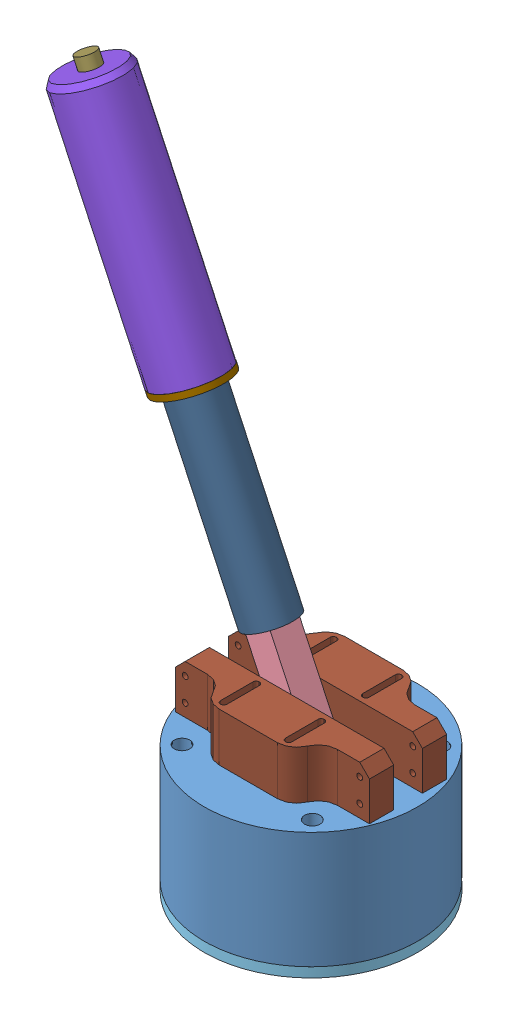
SolidWorks assembly collective.SLDASM, configuration По умолчанию (file format 9000). Lengths in mm.
Overall size (189.21 340.01 110).
14 component instances, 12 part files, 36 mates.
Components (placement in the parent):
- case_collective-1: case_collective.SLDPRT [По умолчанию] at origin size (110 60 110)
- collective_frame_4,5x42mm-1: collective_frame_4,5x42mm.SLDPRT [По умолчанию] at (25.25 42 0) x (0 0 1) z (0 -1 0) size (56 48 30)
- 608_bearing_v1-1: 608_bearing_v1.SLDPRT [По умолчанию] at (9.25 42 10.5) x (1 0 0) z (0 -1 0) size (22 7.15 22)
- 608_bearing_v1-2: 608_bearing_v1.SLDPRT [По умолчанию] at (9.25 42 -10.5) x (1 0 0) z (0 1 0) size (22 7.15 22)
- collective_connector-1: collective_connector.SLDPRT [По умолчанию] at (-4.7734 71.9825 -7.3) x (0 0 1) z (0.423669 -0.905817 0) size (49.8 14.8 74)
- collective_case_bottom_cover-1: collective_case_bottom_cover.SLDPRT [По умолчанию] at (0 -5 0) size (110 30 110)
- aluminium_square_pipe_10x250-1: aluminium_square_pipe_10x250.SLDPRT [По умолчанию] at (7.0893 46.6197 0.1) x (0.905817 0.423669 0) z (0 0 1) size (10 250 10)
- throttle_resistor_mount_v2-1: throttle_resistor_mount_v2.SLDPRT [По умолчанию] at (-111.088 303.7709 0) x (0 0 1) z (0.905817 0.423669 0) size (20 58 22)
- throttle-1: throttle.SLDPRT [По умолчанию] at (-62.0594 194.2255 0) x (-0.28541 -0.133492 -0.949063) z (-0.423669 0.905817 0) size (35 35 123)
- throttle_rear_mount-1: throttle_rear_mount.SLDPRT [По умолчанию] at (-64.1777 198.7546 0) x (-0.905817 -0.423669 0) z (0 0 1) size (35 13 35)
- collective_lever_decorative_cover-1: collective_lever_decorative_cover.SLDPRT [По умолчанию] at (-20.5398 105.4554 0) x (0.905817 0.423669 0) z (0 0 1) size (25 95 25)
- tensioner-3: tensioner.SLDPRT [По умолчанию] at (0.15 60 20) x (0 0 -1) z (1 0 0) size (25 25 100)
- tensioner-4: tensioner.SLDPRT [По умолчанию] at (0.15 60 -19.8) x (0 0 1) z (-1 0 0) size (25 25 100)
- throttle_handle_wedge-1: throttle_handle_wedge.SLDPRT [По умолчанию] at (-116.4891 311.1805 -0.4345) x (-0.447473 -0.209292 0.869462) z (0.787574 0.368364 0.493999) size (10 9 10)
Mates (geometry in assembly coordinates):
- Концентричный2: concentric aligned: cylinder of case_collective-1 through (-16.75 0 -20.5) axis (0 1 0) radius 1.5; cylinder of collective_frame_4,5x42mm-1 through (-16.75 27 -20.5) axis (0 1 0) radius 1.5
- Концентричный4: concentric aligned: cylinder of case_collective-1 through (-16.75 0 20.5) axis (0 1 0) radius 1.5; cylinder of collective_frame_4,5x42mm-1 through (-16.75 27 20.5) axis (0 1 0) radius 1.5
- Совпадение1: coincident anti-aligned: plane of case_collective-1 through (22.5 57 22.5) normal (0 -1 0); plane of collective_frame_4,5x42mm-1 through (-16.75 57 17.5) normal (0 1 0)
- Концентричный5: concentric anti-aligned: cylinder of collective_frame_4,5x42mm-1 through (9.25 42 -10.5) axis (0 0 -1) radius 11.1; cylinder of 608_bearing_v1-2 through (9.25 42 -13.975) axis (0 0 1) radius 11
- Совпадение2: coincident anti-aligned: plane of collective_frame_4,5x42mm-1 through (9.25 42 -10.5) normal (0 0 -1); plane of 608_bearing_v1-2 through (9.25 42 -10.5) normal (0 0 1)
- Концентричный6: concentric anti-aligned: cylinder of collective_frame_4,5x42mm-1 through (9.25 42 10.5) axis (0 0 1) radius 11.1; cylinder of 608_bearing_v1-1 through (9.25 42 13.975) axis (0 0 -1) radius 11
- Совпадение3: coincident anti-aligned: plane of collective_frame_4,5x42mm-1 through (9.25 42 10.5) normal (0 0 1); plane of 608_bearing_v1-1 through (9.25 42 10.5) normal (0 0 -1)
- Концентричный7: concentric aligned: cylinder of 608_bearing_v1-2 through (9.25 42 -13.975) axis (0 0 1) radius 4; cylinder of collective_connector-1 through (9.25 42 -32.3) axis (0 0 1) radius 3.9
- Совпадение4: coincident anti-aligned: plane of 608_bearing_v1-2 through (9.25 42 -10.4) normal (0 0 1); plane of collective_connector-1 through (-4.7734 71.9825 -10.4) normal (0 0 -1)
- Концентричный8: concentric anti-aligned: cylinder of case_collective-1 through (-33.5917 0 -32.8724) axis (0 1 0) radius 4; cylinder of collective_case_bottom_cover-1 through (-33.5917 5 -32.8724) axis (0 -1 0) radius 4.1
- Концентричный9: concentric anti-aligned: cylinder of case_collective-1 through (-33.5917 0 32.8724) axis (0 1 0) radius 4; cylinder of collective_case_bottom_cover-1 through (-33.5917 5 32.8724) axis (0 -1 0) radius 4.1
- Совпадение5: coincident anti-aligned: plane of case_collective-1 through (0 0 0) normal (0 -1 0); plane of collective_case_bottom_cover-1 through (0 0 0) normal (0 1 0)
- Совпадение6: coincident anti-aligned: plane of collective_connector-1 through (2.5602 44.5013 -4.9) normal (0.905817 0.423669 0); plane of aluminium_square_pipe_10x250-1 through (-103.3571 270.9556 5.1) normal (-0.905817 -0.423669 0)
- Совпадение7: coincident anti-aligned: plane of collective_connector-1 through (11.6184 48.738 -4.9) normal (0 0 1); plane of aluminium_square_pipe_10x250-1 through (-94.2989 275.1923 -4.9) normal (0 0 -1)
- Совпадение8: coincident anti-aligned: plane of collective_connector-1 through (7.0893 46.6197 -7.3) normal (-0.423669 0.905817 0); plane of aluminium_square_pipe_10x250-1 through (7.0893 46.6197 0.1) normal (0.423669 -0.905817 0)
- Совпадение9: coincident anti-aligned: plane of aluminium_square_pipe_10x250-1 through (-94.2989 275.1923 5.1) normal (0.905817 0.423669 0); plane of throttle_resistor_mount_v2-1 through (-94.2989 275.1923 -5.1) normal (-0.905817 -0.423669 0)
- Совпадение10: coincident anti-aligned: plane of aluminium_square_pipe_10x250-1 through (-94.2989 275.1923 5.1) normal (0 0 1); plane of throttle_resistor_mount_v2-1 through (-94.2989 275.1923 5.1) normal (0 0 -1)
- Совпадение11: coincident anti-aligned: plane of aluminium_square_pipe_10x250-1 through (-98.828 273.0739 0.1) normal (-0.423669 0.905817 0); plane of throttle_resistor_mount_v2-1 through (-97.1069 273.8789 0) normal (0.423669 -0.905817 0)
- Концентричный10: concentric anti-aligned: cylinder of throttle_resistor_mount_v2-1 through (-111.6286 300.2061 0) axis (-0.423669 0.905817 0) radius 3.5; cylinder of throttle-1 through (-114.1706 305.641 0) axis (0.423669 -0.905817 0) radius 3
- Концентричный11: concentric anti-aligned: cylinder of throttle-1 through (-112.8996 302.9235 0) axis (0.423669 -0.905817 0) radius 15; cylinder of throttle_rear_mount-1 through (-62.0594 194.2255 0) axis (-0.423669 0.905817 0) radius 14.8
- Совпадение14: coincident anti-aligned: plane of aluminium_square_pipe_10x250-1 through (-94.2989 275.1923 5.1) normal (0 0 1); plane of collective_lever_decorative_cover-1 through (-56.1687 193.6687 5.1) normal (0 0 -1)
- Совпадение15: coincident anti-aligned: plane of aluminium_square_pipe_10x250-1 through (-94.2989 275.1923 5.1) normal (0.905817 0.423669 0); plane of collective_lever_decorative_cover-1 through (-56.1687 193.6687 5.1) normal (-0.905817 -0.423669 0)
- Совпадение16: coincident anti-aligned: plane of throttle_rear_mount-1 through (-60.7883 191.508 0) normal (0.423669 -0.905817 0); plane of collective_lever_decorative_cover-1 through (-60.7883 191.508 0) normal (-0.423669 0.905817 0)
- Совпадение19: coincident anti-aligned: plane of case_collective-1 through (0 60 0) normal (0 1 0); plane of tensioner-4 through (0.15 60 -19.8) normal (0 -1 0)
- Касательность3: tangent anti-aligned: cylinder of case_collective-1 through (-16.75 0 -20.5) axis (0 1 0) radius 1.5; plane of tensioner-4 through (-18.25 85 -9.8) normal (1 0 0)
- Касательность5: tangent anti-aligned: cylinder of case_collective-1 through (16.75 0 -20.5) axis (0 1 0) radius 1.5; plane of tensioner-4 through (15.25 85 -9.8) normal (1 0 0)
- Совпадение20: coincident anti-aligned: plane of case_collective-1 through (0 60 0) normal (0 1 0); plane of tensioner-3 through (0.15 60 20) normal (0 -1 0)
- Касательность6: tangent anti-aligned: cylinder of case_collective-1 through (-16.75 0 20.5) axis (0 1 0) radius 1.5; plane of tensioner-3 through (-18.25 85 10) normal (1 0 0)
- Совпадение21: coincident anti-aligned: plane of collective_connector-1 through (-4.7734 71.9825 7.5) normal (0 0 1); plane of tensioner-3 through (50.15 85 7.5) normal (0 0 -1)
- Совпадение22: coincident anti-aligned: plane of collective_connector-1 through (-4.7734 71.9825 -7.3) normal (0 0 -1); plane of tensioner-4 through (-49.85 85 -7.3) normal (0 0 1)
- Концентричный16: concentric aligned: cylinder of throttle-1 through (-114.1706 305.641 0) axis (0.423669 -0.905817 0) radius 3; cylinder of throttle_handle_wedge-1 through (-115.8653 309.2642 0) axis (0.423669 -0.905817 0) radius 3.2
- Совпадение23: coincident anti-aligned: plane of collective_connector-1 through (-13.7462 108.6329 7.5) normal (-0.423669 0.905817 0); plane of collective_lever_decorative_cover-1 through (-20.5398 105.4554 0) normal (0.423669 -0.905817 0)
- Параллельность1: parallel anti-aligned: plane of aluminium_square_pipe_10x250-1 through (-103.3571 270.9556 5.1) normal (-0.905817 -0.423669 0); plane of throttle_rear_mount-1 through (-68.7974 196.5939 5.1) normal (0.905817 0.423669 0)
- Угол1: planar angle anti-aligned: plane of throttle-1 through (-83.4279 206.3105 4.7263) normal (-0.28541 -0.133492 -0.949063); plane of throttle_rear_mount-1 through (-79.0193 197.3327 4.6633) normal (0.28541 0.133492 0.949063)
- Совпадение27: coincident anti-aligned: plane of throttle-1 through (-62.0594 194.2255 0) normal (0.423669 -0.905817 0); plane of throttle_rear_mount-1 through (-62.0594 194.2255 0) normal (-0.423669 0.905817 0)
- Совпадение28: coincident anti-aligned: plane of throttle-1 through (-114.1706 305.641 0) normal (-0.423669 0.905817 0); plane of throttle_handle_wedge-1 through (-113.947 305.7456 -0.4345) normal (0.423669 -0.905817 0)
